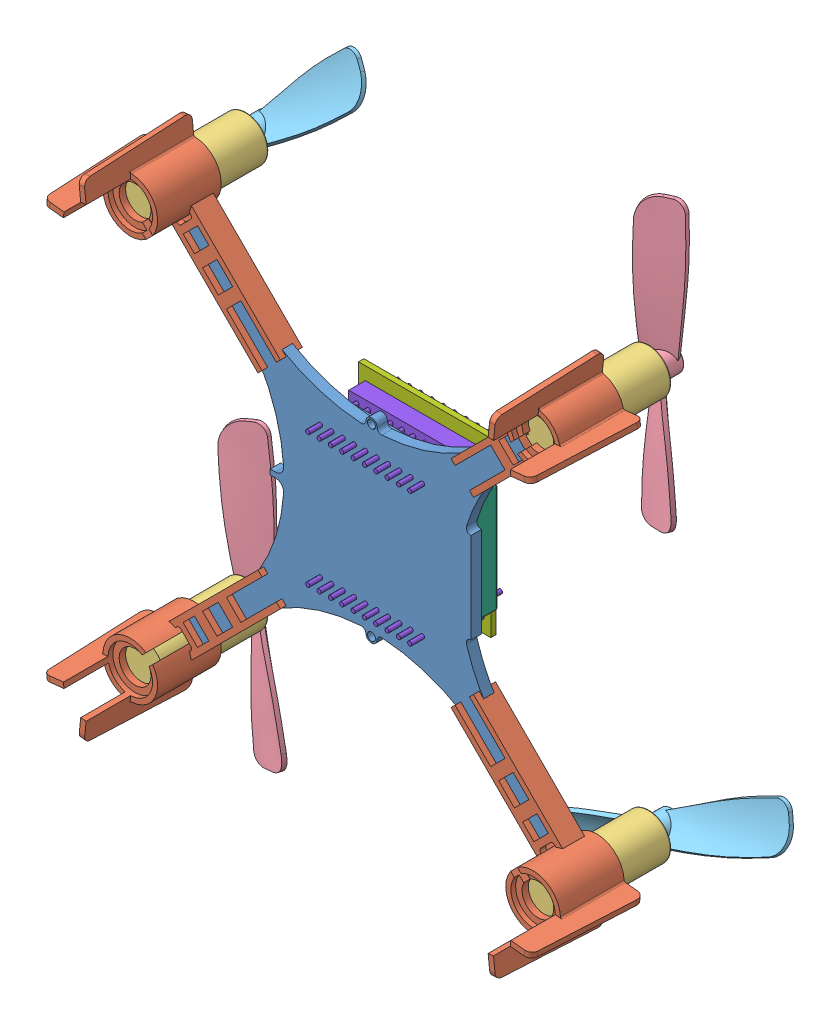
SolidWorks assembly Crazyflie_assembly.SLDASM, configuration Default (file format 8000). Lengths in mm.
Overall size (105.01 110.34 28.75).
17 component instances, 8 part files, 40 mates.
Components (placement in the parent):
- pcb-1: pcb.SLDPRT [Default] at (27.046 35.5941 38.2786) size (58.8 58.8 4.25)
- 7mm motor mount-1: 7mm motor mount.SLDPRT [Default] at (58.6891 67.2371 36.1786) x (-1 0 0) z (0 -1 0) size (25.7 17 25.69)
- 7mm motor mount-3: 7mm motor mount.SLDPRT [Default] at (-4.597 67.2371 36.1786) x (0 -1 0) z (1 0 0) size (25.7 17 25.69)
- 7mm motor mount-4: 7mm motor mount.SLDPRT [Default] at (-4.597 3.951 36.1786) x (1 0 0) z (0 1 0) size (25.7 17 25.69)
- 7mm motor mount-5: 7mm motor mount.SLDPRT [Default] at (58.6891 3.951 36.1786) x (0 1 0) z (-1 0 0) size (25.7 17 25.69)
- 7x15 motor-1: 7x15 motor.SLDPRT [Default] at (-4.597 67.2371 43.9286) x (0.983151 0.182793 0) z (-0.182793 0.983151 0) size (7 20 7)
- 7x15 motor-2: 7x15 motor.SLDPRT [Default] at (58.6891 3.951 43.9286) x (0.153368 0.988169 0) z (-0.988169 0.153368 0) size (7 20 7)
- 7x15 motor-3: 7x15 motor.SLDPRT [Default] at (58.6891 67.2371 43.9286) x (0.896202 0.443646 0) z (-0.443646 0.896202 0) size (7 20 7)
- 7x15 motor-4: 7x15 motor.SLDPRT [Default] at (-4.597 3.951 43.9286) x (0.267826 0.963467 0) z (-0.963467 0.267826 0) size (7 20 7)
- propeller_ccw-1: propeller_ccw.SLDPRT [Default] at (26.8693 67.2371 37.4094) x (1 0 0) z (0 1 0) size (7.06 3.59 46.81)
- propeller_ccw-2: propeller_ccw.SLDPRT [Default] at (-36.2294 0.5025 37.4094) x (0.99411 0.108378 0) z (-0.108378 0.99411 0) size (7.06 3.59 46.81)
- propeller_cw-1: propeller_cw.SLDPRT [Default] at (73.0125 -24.4627 37.4094) x (-0.450142 0.892957 0) z (-0.892957 -0.450142 0) size (7.06 3.54 46.8)
- propeller_cw-2: propeller_cw.SLDPRT [Default] at (-26.7827 90.0471 37.4094) x (0.697229 -0.716848 0) z (0.716848 0.697229 0) size (7.06 3.54 46.8)
- battery bc-bl-01-a-1: battery bc-bl-01-a.SLDPRT [Default] at (15.546 43.3661 38.2786) x (1 0 0) z (0 1 0) size (23 6.7 17)
- battery holder board-1: battery holder board.SLDPRT [Default] at (16.657 22.0191 30.7286) x (1 0 0) z (0 -1 0) size (20.78 0.85 27.15)
- header-1: header.SLDPRT [Default] at (17.716 47.1361 34.1786) x (1 0 0) z (0 1 0) size (18.66 14.28 2.31)
- header-2: header.SLDPRT [Default] at (17.716 26.3661 34.1786) x (1 0 0) z (0 1 0) size (18.66 14.28 2.31)
Mates (geometry in assembly coordinates):
- Coincident2: coincident aligned: plane of pcb-1 through (56.444 62.7293 39.9286) normal (0.707107 0.707107 0); plane of 7mm motor mount-1 through (56.0545 63.1187 44.367) normal (0.707107 0.707107 0)
- Coincident3: coincident anti-aligned: plane of pcb-1 through (27.046 50.0431 38.2786) normal (0 0 -1); plane of 7mm motor mount-1 through (43.3448 49.6301 38.2786) normal (0 0 1)
- Coincident4: coincident anti-aligned: plane of pcb-1 through (48.9011 55.1864 39.9286) normal (0.707107 -0.707107 0); plane of 7mm motor mount-1 through (43.3448 49.6301 38.2786) normal (-0.707107 0.707107 0)
- Coincident5: coincident aligned: plane of pcb-1 through (-0.0892 64.992 39.9286) normal (-0.707107 0.707107 0); plane of 7mm motor mount-3 through (-0.4786 64.6026 44.367) normal (-0.707107 0.707107 0)
- Coincident6: coincident anti-aligned: plane of pcb-1 through (27.046 50.0431 38.2786) normal (0 0 -1); plane of 7mm motor mount-3 through (13.01 51.8929 38.2786) normal (0 0 1)
- Coincident7: coincident anti-aligned: plane of pcb-1 through (7.4537 57.4491 39.9286) normal (0.707107 0.707107 0); plane of 7mm motor mount-3 through (13.01 51.8929 38.2786) normal (-0.707107 -0.707107 0)
- Coincident8: coincident anti-aligned: plane of pcb-1 through (27.046 50.0431 38.2786) normal (0 0 -1); plane of 7mm motor mount-4 through (10.7472 21.558 38.2786) normal (0 0 1)
- Coincident9: coincident anti-aligned: plane of pcb-1 through (5.191 16.0017 39.9286) normal (-0.707107 0.707107 0); plane of 7mm motor mount-4 through (10.7472 21.558 38.2786) normal (0.707107 -0.707107 0)
- Coincident10: coincident aligned: plane of pcb-1 through (-2.3519 8.4588 39.9286) normal (-0.707107 -0.707107 0); plane of 7mm motor mount-4 through (-1.9625 8.0694 44.367) normal (-0.707107 -0.707107 0)
- Coincident11: coincident aligned: plane of pcb-1 through (54.1813 6.1961 39.9286) normal (0.707107 -0.707107 0); plane of 7mm motor mount-5 through (54.5707 6.5856 44.367) normal (0.707107 -0.707107 0)
- Coincident12: coincident anti-aligned: plane of pcb-1 through (27.046 50.0431 38.2786) normal (0 0 -1); plane of 7mm motor mount-5 through (41.0821 19.2953 38.2786) normal (0 0 1)
- Coincident13: coincident anti-aligned: plane of pcb-1 through (46.6384 13.739 39.9286) normal (-0.707107 -0.707107 0); plane of 7mm motor mount-5 through (41.0821 19.2953 38.2786) normal (0.707107 0.707107 0)
- Concentric1: concentric anti-aligned: cylinder of 7mm motor mount-3 through (-4.597 67.2371 46.1786) axis (0 0 -1) radius 3.5; cylinder of 7x15 motor-1 through (-4.597 67.2371 27.9286) axis (0 0 1) radius 3.5
- Coincident14: coincident anti-aligned: plane of 7mm motor mount-3 through (-4.597 67.2371 44.4286) normal (0 0 -1); plane of 7x15 motor-1 through (-4.597 67.2371 44.4286) normal (0 0 1)
- Concentric2: concentric anti-aligned: cylinder of 7mm motor mount-4 through (-4.597 3.951 46.1786) axis (0 0 -1) radius 3.5; cylinder of 7x15 motor-4 through (-4.597 3.951 27.9286) axis (0 0 1) radius 3.5
- Coincident15: coincident anti-aligned: plane of 7mm motor mount-4 through (-4.597 3.951 44.4286) normal (0 0 -1); plane of 7x15 motor-4 through (-4.597 3.951 44.4286) normal (0 0 1)
- Concentric3: concentric anti-aligned: cylinder of 7mm motor mount-5 through (58.6891 3.951 46.1786) axis (0 0 -1) radius 3.5; cylinder of 7x15 motor-2 through (58.6891 3.951 27.9286) axis (0 0 1) radius 3.5
- Coincident16: coincident anti-aligned: plane of 7mm motor mount-5 through (58.6891 3.951 44.4286) normal (0 0 -1); plane of 7x15 motor-2 through (58.6891 3.951 44.4286) normal (0 0 1)
- Concentric4: concentric anti-aligned: cylinder of 7mm motor mount-1 through (58.6891 67.2371 46.1786) axis (0 0 -1) radius 3.5; cylinder of 7x15 motor-3 through (58.6891 67.2371 27.9286) axis (0 0 1) radius 3.5
- Coincident17: coincident anti-aligned: plane of 7mm motor mount-1 through (58.6891 67.2371 44.4286) normal (0 0 -1); plane of 7x15 motor-3 through (58.6891 67.2371 44.4286) normal (0 0 1)
- Concentric5: concentric anti-aligned: cylinder of 7x15 motor-3 through (58.6891 67.2371 24.4286) axis (0 0 1) radius 0.4; cylinder of propeller_ccw-1 through (58.6891 67.2371 27.966) axis (0 0 -1) radius 0.35
- Coincident18: coincident anti-aligned: plane of 7x15 motor-3 through (58.6891 67.2371 27.9286) normal (0 0 -1); plane of propeller_ccw-1 through (58.6891 67.2371 27.9286) normal (0 0 1)
- Concentric6: concentric anti-aligned: cylinder of 7x15 motor-4 through (-4.597 3.951 24.4286) axis (0 0 1) radius 0.4; cylinder of propeller_ccw-2 through (-4.597 3.951 27.966) axis (0 0 -1) radius 0.35
- Coincident19: coincident anti-aligned: plane of 7x15 motor-4 through (-4.597 3.951 27.9286) normal (0 0 -1); plane of propeller_ccw-2 through (-4.597 3.951 27.9286) normal (0 0 1)
- Concentric7: concentric anti-aligned: cylinder of 7x15 motor-2 through (58.6891 3.951 24.4286) axis (0 0 1) radius 0.4; cylinder of propeller_cw-1 through (58.6891 3.951 27.966) axis (0 0 -1) radius 0.35
- Coincident20: coincident anti-aligned: plane of 7x15 motor-2 through (58.6891 3.951 27.9286) normal (0 0 -1); plane of propeller_cw-1 through (58.6891 3.951 27.9286) normal (0 0 1)
- Concentric8: concentric anti-aligned: cylinder of 7x15 motor-1 through (-4.597 67.2371 24.4286) axis (0 0 1) radius 0.4; cylinder of propeller_cw-2 through (-4.597 67.2371 27.966) axis (0 0 -1) radius 0.35
- Coincident21: coincident anti-aligned: plane of 7x15 motor-1 through (-4.597 67.2371 27.9286) normal (0 0 -1); plane of propeller_cw-2 through (-4.597 67.2371 27.9286) normal (0 0 1)
- Coincident22: coincident anti-aligned: plane of pcb-1 through (27.046 50.0431 38.2786) normal (0 0 -1); plane of battery bc-bl-01-a-1 through (15.546 43.3661 38.2786) normal (0 0 1)
- Coincident23: coincident anti-aligned: plane of pcb-1 through (15.546 26.3661 35.6786) normal (0 1 0); plane of battery bc-bl-01-a-1 through (15.546 26.3661 31.5786) normal (0 -1 0)
- Coincident24: coincident aligned: plane of pcb-1 through (15.546 44.8221 35.6786) normal (-1 0 0); plane of battery bc-bl-01-a-1 through (15.546 43.3661 31.5786) normal (-1 0 0)
- Coincident25: coincident anti-aligned: plane of battery bc-bl-01-a-1 through (15.546 43.3661 31.5786) normal (0 0 -1); plane of battery holder board-1 through (0.2529 30.9256 31.5786) normal (0 0 1)
- Concentric9: concentric anti-aligned: cylinder of pcb-1 through (19.046 45.9791 35.6786) axis (0 0 1) radius 0.33; cylinder of header-1 through (19.046 45.9791 41.9486) axis (0 0 -1) radius 0.33
- Concentric10: concentric aligned: cylinder of battery holder board-1 through (30.2524 34.531 31.5786) axis (0 0 -1) radius 0.33; cylinder of header-1 through (30.2524 34.531 41.9486) axis (0 0 -1) radius 0.33
- Coincident26: coincident anti-aligned: plane of battery holder board-1 through (0.2529 30.9256 31.5786) normal (0 0 1); plane of header-1 through (18.9425 47.7388 31.5786) normal (0 0 -1)
- Concentric11: concentric aligned: cylinder of battery holder board-1 through (19.046 45.9791 31.5786) axis (0 0 -1) radius 0.33; cylinder of header-1 through (19.046 45.9791 41.9486) axis (0 0 -1) radius 0.33
- Concentric13: concentric aligned: cylinder of battery holder board-1 through (4.2036 31.4499 31.5786) axis (0 0 -1) radius 0.33; cylinder of header-2 through (4.2036 31.4499 41.9486) axis (0 0 -1) radius 0.33
- Concentric14: concentric aligned: cylinder of battery holder board-1 through (15.41 20.0019 31.5786) axis (0 0 -1) radius 0.33; cylinder of header-2 through (15.41 20.0019 41.9486) axis (0 0 -1) radius 0.33
- Coincident27: coincident anti-aligned: plane of battery holder board-1 through (0.2529 30.9256 31.5786) normal (0 0 1); plane of header-2 through (4.1001 33.2097 31.5786) normal (0 0 -1)
- Concentric23: concentric anti-aligned: cylinder of pcb-1 through (19.046 25.2091 35.6786) axis (0 0 1) radius 0.33; cylinder of header-2 through (19.046 25.2091 41.9486) axis (0 0 -1) radius 0.33
